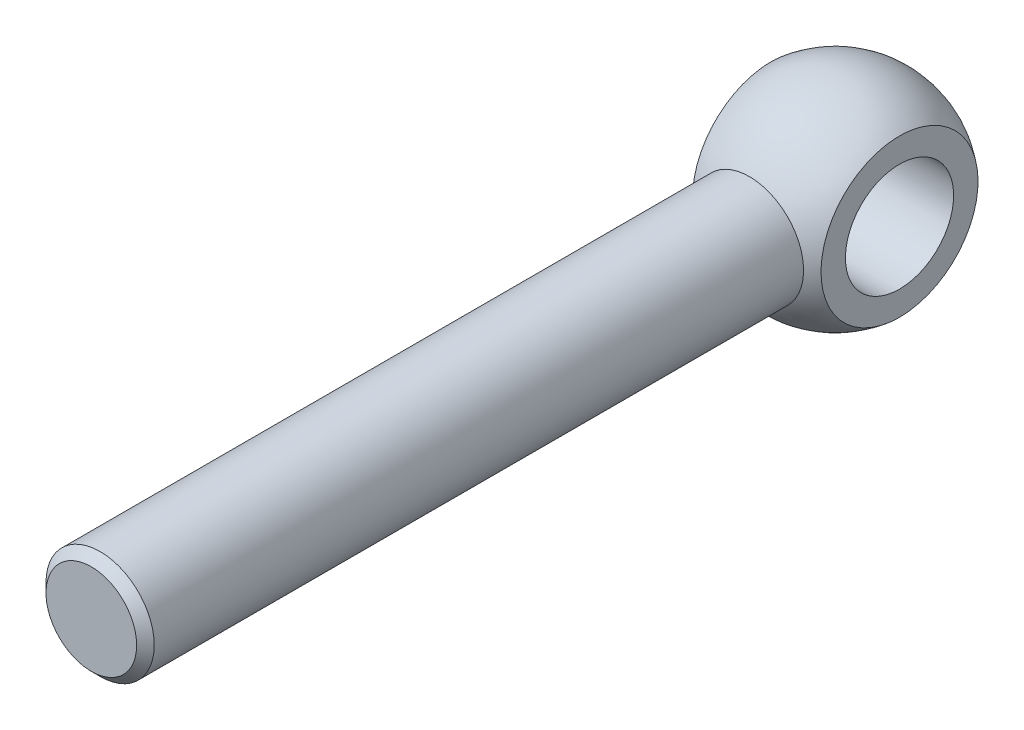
ISO-10303-21;
HEADER;
FILE_DESCRIPTION(('STEP AP214'),'2;1');
FILE_NAME('part.step','',(''),(''),'','','');
FILE_SCHEMA(('AUTOMOTIVE_DESIGN { 1 0 10303 214 1 1 1 1 }'));
ENDSEC;
DATA;
#1=APPLICATION_CONTEXT('core data for automotive mechanical design processes');
#2=APPLICATION_PROTOCOL_DEFINITION('international standard','automotive_design',2000,#1);
#3=PRODUCT_CONTEXT('',#1,'mechanical');
#4=PRODUCT('Part','Part','',(#3));
#5=PRODUCT_RELATED_PRODUCT_CATEGORY('part','',(#4));
#6=PRODUCT_DEFINITION_FORMATION('','',#4);
#7=PRODUCT_DEFINITION_CONTEXT('part definition',#1,'design');
#8=PRODUCT_DEFINITION('design','',#6,#7);
#9=PRODUCT_DEFINITION_SHAPE('','',#8);
#10=(LENGTH_UNIT() NAMED_UNIT(*) SI_UNIT(.MILLI.,.METRE.));
#11=(NAMED_UNIT(*) PLANE_ANGLE_UNIT() SI_UNIT($,.RADIAN.));
#12=(NAMED_UNIT(*) SI_UNIT($,.STERADIAN.) SOLID_ANGLE_UNIT());
#13=UNCERTAINTY_MEASURE_WITH_UNIT(LENGTH_MEASURE(1.E-05),#10,'distance_accuracy_value','');
#14=(GEOMETRIC_REPRESENTATION_CONTEXT(3) GLOBAL_UNCERTAINTY_ASSIGNED_CONTEXT((#13)) GLOBAL_UNIT_ASSIGNED_CONTEXT((#10,
#11,#12)) REPRESENTATION_CONTEXT('',''));
#15=CARTESIAN_POINT('',(0.,0.,0.));
#16=DIRECTION('',(0.,0.,1.));
#17=DIRECTION('',(1.,0.,0.));
#18=AXIS2_PLACEMENT_3D('',#15,#16,#17);
#19=CARTESIAN_POINT('',(0.,0.,0.));
#20=DIRECTION('',(0.,-1.,0.));
#21=DIRECTION('',(-1.,0.,0.));
#22=AXIS2_PLACEMENT_3D('',#19,#20,#21);
#23=SPHERICAL_SURFACE('',#22,7.5);
#24=CARTESIAN_POINT('',(-4.75,0.,0.));
#25=DIRECTION('',(1.,0.,0.));
#26=DIRECTION('',(0.,1.,0.));
#27=AXIS2_PLACEMENT_3D('',#24,#25,#26);
#28=CIRCLE('',#27,5.80409338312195);
#29=CARTESIAN_POINT('',(-4.75,5.80409338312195,0.));
#30=VERTEX_POINT('',#29);
#31=EDGE_CURVE('E50',#30,#30,#28,.T.);
#32=ORIENTED_EDGE('',*,*,#31,.T.);
#33=EDGE_LOOP('',(#32));
#34=FACE_BOUND('',#33,.T.);
#35=CARTESIAN_POINT('',(4.75,0.,0.));
#36=DIRECTION('',(-1.,0.,0.));
#37=DIRECTION('',(0.,-1.,0.));
#38=AXIS2_PLACEMENT_3D('',#35,#36,#37);
#39=CIRCLE('',#38,5.80409338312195);
#40=CARTESIAN_POINT('',(4.75,-5.80409338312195,0.));
#41=VERTEX_POINT('',#40);
#42=EDGE_CURVE('E53',#41,#41,#39,.T.);
#43=ORIENTED_EDGE('',*,*,#42,.T.);
#44=EDGE_LOOP('',(#43));
#45=FACE_BOUND('',#44,.T.);
#46=CARTESIAN_POINT('',(0.,0.,6.34428877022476));
#47=DIRECTION('',(0.,0.,-1.));
#48=DIRECTION('',(-1.,0.,0.));
#49=AXIS2_PLACEMENT_3D('',#46,#47,#48);
#50=CIRCLE('',#49,4.);
#51=CARTESIAN_POINT('',(-4.,0.,6.34428877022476));
#52=VERTEX_POINT('',#51);
#53=EDGE_CURVE('E46',#52,#52,#50,.F.);
#54=ORIENTED_EDGE('',*,*,#53,.F.);
#55=EDGE_LOOP('',(#54));
#56=FACE_BOUND('',#55,.T.);
#57=ADVANCED_FACE('F35',(#34,#45,#56),#23,.T.);
#58=CARTESIAN_POINT('',(-4.75,7.20813774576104,-7.5));
#59=DIRECTION('',(1.,0.,0.));
#60=DIRECTION('',(0.,1.,0.));
#61=AXIS2_PLACEMENT_3D('',#58,#59,#60);
#62=PLANE('',#61);
#63=CARTESIAN_POINT('',(-4.75,0.,0.));
#64=DIRECTION('',(-1.,0.,0.));
#65=DIRECTION('',(0.,-1.,0.));
#66=AXIS2_PLACEMENT_3D('',#63,#64,#65);
#67=CIRCLE('',#66,4.);
#68=CARTESIAN_POINT('',(-4.75,-4.,0.));
#69=VERTEX_POINT('',#68);
#70=EDGE_CURVE('E59',#69,#69,#67,.T.);
#71=ORIENTED_EDGE('',*,*,#70,.F.);
#72=EDGE_LOOP('',(#71));
#73=FACE_BOUND('',#72,.T.);
#74=ORIENTED_EDGE('',*,*,#31,.F.);
#75=EDGE_LOOP('',(#74));
#76=FACE_BOUND('',#75,.T.);
#77=ADVANCED_FACE('F74',(#73,#76),#62,.F.);
#78=CARTESIAN_POINT('',(4.75,7.20813774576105,-7.5));
#79=DIRECTION('',(-1.,0.,0.));
#80=DIRECTION('',(0.,-1.,0.));
#81=AXIS2_PLACEMENT_3D('',#78,#79,#80);
#82=PLANE('',#81);
#83=CARTESIAN_POINT('',(4.75,0.,0.));
#84=DIRECTION('',(-1.,0.,0.));
#85=DIRECTION('',(0.,-1.,0.));
#86=AXIS2_PLACEMENT_3D('',#83,#84,#85);
#87=CIRCLE('',#86,4.);
#88=CARTESIAN_POINT('',(4.75,-4.,0.));
#89=VERTEX_POINT('',#88);
#90=EDGE_CURVE('E56',#89,#89,#87,.T.);
#91=ORIENTED_EDGE('',*,*,#90,.T.);
#92=EDGE_LOOP('',(#91));
#93=FACE_BOUND('',#92,.T.);
#94=ORIENTED_EDGE('',*,*,#42,.F.);
#95=EDGE_LOOP('',(#94));
#96=FACE_BOUND('',#95,.T.);
#97=ADVANCED_FACE('F65',(#93,#96),#82,.F.);
#98=CARTESIAN_POINT('',(0.,0.,55.));
#99=DIRECTION('',(0.,0.,-1.));
#100=DIRECTION('',(-1.,0.,0.));
#101=AXIS2_PLACEMENT_3D('',#98,#99,#100);
#102=CYLINDRICAL_SURFACE('',#101,4.);
#103=CARTESIAN_POINT('',(0.,0.,54.35));
#104=DIRECTION('',(0.,0.,1.));
#105=DIRECTION('',(1.,0.,0.));
#106=AXIS2_PLACEMENT_3D('',#103,#104,#105);
#107=CIRCLE('',#106,4.);
#108=CARTESIAN_POINT('',(4.,0.,54.35));
#109=VERTEX_POINT('',#108);
#110=EDGE_CURVE('E10',#109,#109,#107,.F.);
#111=ORIENTED_EDGE('',*,*,#110,.T.);
#112=EDGE_LOOP('',(#111));
#113=FACE_BOUND('',#112,.T.);
#114=ORIENTED_EDGE('',*,*,#53,.T.);
#115=EDGE_LOOP('',(#114));
#116=FACE_BOUND('',#115,.T.);
#117=ADVANCED_FACE('F86',(#113,#116),#102,.T.);
#118=CARTESIAN_POINT('',(0.,0.,55.));
#119=DIRECTION('',(0.,0.,1.));
#120=DIRECTION('',(1.,0.,0.));
#121=AXIS2_PLACEMENT_3D('',#118,#119,#120);
#122=PLANE('',#121);
#123=CARTESIAN_POINT('',(0.,0.,55.));
#124=DIRECTION('',(0.,0.,1.));
#125=DIRECTION('',(1.,0.,0.));
#126=AXIS2_PLACEMENT_3D('',#123,#124,#125);
#127=CIRCLE('',#126,3.34999999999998);
#128=CARTESIAN_POINT('',(3.34999999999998,0.,55.));
#129=VERTEX_POINT('',#128);
#130=EDGE_CURVE('E42',#129,#129,#127,.T.);
#131=ORIENTED_EDGE('',*,*,#130,.T.);
#132=EDGE_LOOP('',(#131));
#133=FACE_BOUND('',#132,.T.);
#134=ADVANCED_FACE('F88',(#133),#122,.T.);
#135=CARTESIAN_POINT('',(0.,0.,55.));
#136=DIRECTION('',(0.,0.,-1.));
#137=DIRECTION('',(-1.,0.,0.));
#138=AXIS2_PLACEMENT_3D('',#135,#136,#137);
#139=CONICAL_SURFACE('',#138,3.34999999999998,0.785398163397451);
#140=ORIENTED_EDGE('',*,*,#110,.F.);
#141=EDGE_LOOP('',(#140));
#142=FACE_BOUND('',#141,.T.);
#143=ORIENTED_EDGE('',*,*,#130,.F.);
#144=EDGE_LOOP('',(#143));
#145=FACE_BOUND('',#144,.T.);
#146=ADVANCED_FACE('F37',(#142,#145),#139,.T.);
#147=CARTESIAN_POINT('',(4.75,0.,0.));
#148=DIRECTION('',(-1.,0.,0.));
#149=DIRECTION('',(0.,-1.,0.));
#150=AXIS2_PLACEMENT_3D('',#147,#148,#149);
#151=CYLINDRICAL_SURFACE('',#150,4.);
#152=ORIENTED_EDGE('',*,*,#90,.F.);
#153=EDGE_LOOP('',(#152));
#154=FACE_BOUND('',#153,.T.);
#155=ORIENTED_EDGE('',*,*,#70,.T.);
#156=EDGE_LOOP('',(#155));
#157=FACE_BOUND('',#156,.T.);
#158=ADVANCED_FACE('F68',(#154,#157),#151,.F.);
#159=CLOSED_SHELL('',(#57,#77,#97,#117,#134,#146,#158));
#160=MANIFOLD_SOLID_BREP('B2',#159);
#161=ADVANCED_BREP_SHAPE_REPRESENTATION('',(#18,#160),#14);
#162=SHAPE_DEFINITION_REPRESENTATION(#9,#161);
ENDSEC;
END-ISO-10303-21;
